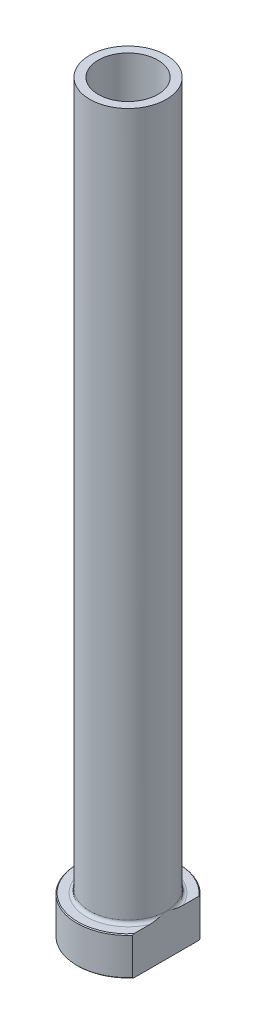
ISO-10303-21;
HEADER;
FILE_DESCRIPTION(('STEP AP214'),'2;1');
FILE_NAME('part.step','',(''),(''),'','','');
FILE_SCHEMA(('AUTOMOTIVE_DESIGN { 1 0 10303 214 1 1 1 1 }'));
ENDSEC;
DATA;
#1=APPLICATION_CONTEXT('core data for automotive mechanical design processes');
#2=APPLICATION_PROTOCOL_DEFINITION('international standard','automotive_design',2000,#1);
#3=PRODUCT_CONTEXT('',#1,'mechanical');
#4=PRODUCT('Part','Part','',(#3));
#5=PRODUCT_RELATED_PRODUCT_CATEGORY('part','',(#4));
#6=PRODUCT_DEFINITION_FORMATION('','',#4);
#7=PRODUCT_DEFINITION_CONTEXT('part definition',#1,'design');
#8=PRODUCT_DEFINITION('design','',#6,#7);
#9=PRODUCT_DEFINITION_SHAPE('','',#8);
#10=(LENGTH_UNIT() NAMED_UNIT(*) SI_UNIT(.MILLI.,.METRE.));
#11=(NAMED_UNIT(*) PLANE_ANGLE_UNIT() SI_UNIT($,.RADIAN.));
#12=(NAMED_UNIT(*) SI_UNIT($,.STERADIAN.) SOLID_ANGLE_UNIT());
#13=UNCERTAINTY_MEASURE_WITH_UNIT(LENGTH_MEASURE(1.E-05),#10,'distance_accuracy_value','');
#14=(GEOMETRIC_REPRESENTATION_CONTEXT(3) GLOBAL_UNCERTAINTY_ASSIGNED_CONTEXT((#13)) GLOBAL_UNIT_ASSIGNED_CONTEXT((#10,
#11,#12)) REPRESENTATION_CONTEXT('',''));
#15=CARTESIAN_POINT('',(0.,0.,0.));
#16=DIRECTION('',(0.,0.,1.));
#17=DIRECTION('',(1.,0.,0.));
#18=AXIS2_PLACEMENT_3D('',#15,#16,#17);
#19=CARTESIAN_POINT('',(0.,92.1876809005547,0.));
#20=DIRECTION('',(0.,1.,0.));
#21=DIRECTION('',(0.,0.,1.));
#22=AXIS2_PLACEMENT_3D('',#19,#20,#21);
#23=CYLINDRICAL_SURFACE('',#22,7.);
#24=CARTESIAN_POINT('',(0.,175.,0.));
#25=DIRECTION('',(0.,1.,0.));
#26=DIRECTION('',(0.,0.,1.));
#27=AXIS2_PLACEMENT_3D('',#24,#25,#26);
#28=CIRCLE('',#27,7.);
#29=CARTESIAN_POINT('',(0.,175.,7.));
#30=VERTEX_POINT('',#29);
#31=EDGE_CURVE('E167',#30,#30,#28,.T.);
#32=ORIENTED_EDGE('',*,*,#31,.T.);
#33=EDGE_LOOP('',(#32));
#34=FACE_BOUND('',#33,.T.);
#35=CARTESIAN_POINT('',(0.,120.,0.));
#36=DIRECTION('',(0.,1.,0.));
#37=DIRECTION('',(0.,0.,1.));
#38=AXIS2_PLACEMENT_3D('',#35,#36,#37);
#39=CIRCLE('',#38,7.);
#40=CARTESIAN_POINT('',(0.,120.,7.));
#41=VERTEX_POINT('',#40);
#42=EDGE_CURVE('E170',#41,#41,#39,.T.);
#43=ORIENTED_EDGE('',*,*,#42,.F.);
#44=EDGE_LOOP('',(#43));
#45=FACE_BOUND('',#44,.T.);
#46=ADVANCED_FACE('F32',(#34,#45),#23,.F.);
#47=CARTESIAN_POINT('',(-7.,175.,0.));
#48=DIRECTION('',(0.,1.,0.));
#49=DIRECTION('',(0.,0.,1.));
#50=AXIS2_PLACEMENT_3D('',#47,#48,#49);
#51=PLANE('',#50);
#52=CARTESIAN_POINT('',(0.,175.,0.));
#53=DIRECTION('',(0.,1.,0.));
#54=DIRECTION('',(0.,0.,1.));
#55=AXIS2_PLACEMENT_3D('',#52,#53,#54);
#56=CIRCLE('',#55,9.00000000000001);
#57=CARTESIAN_POINT('',(0.,175.,9.00000000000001));
#58=VERTEX_POINT('',#57);
#59=EDGE_CURVE('E174',#58,#58,#56,.T.);
#60=ORIENTED_EDGE('',*,*,#59,.T.);
#61=EDGE_LOOP('',(#60));
#62=FACE_BOUND('',#61,.T.);
#63=ORIENTED_EDGE('',*,*,#31,.F.);
#64=EDGE_LOOP('',(#63));
#65=FACE_BOUND('',#64,.T.);
#66=ADVANCED_FACE('F157',(#62,#65),#51,.T.);
#67=CARTESIAN_POINT('',(0.,92.1876809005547,0.));
#68=DIRECTION('',(0.,1.,0.));
#69=DIRECTION('',(0.,0.,1.));
#70=AXIS2_PLACEMENT_3D('',#67,#68,#69);
#71=CYLINDRICAL_SURFACE('',#70,9.);
#72=CARTESIAN_POINT('',(0.,9.8,0.));
#73=DIRECTION('',(0.,1.,0.));
#74=DIRECTION('',(0.,0.,1.));
#75=AXIS2_PLACEMENT_3D('',#72,#73,#74);
#76=CIRCLE('',#75,9.);
#77=CARTESIAN_POINT('',(9.,9.8,0.));
#78=VERTEX_POINT('',#77);
#79=EDGE_CURVE('E180',#78,#78,#76,.T.);
#80=ORIENTED_EDGE('',*,*,#79,.T.);
#81=EDGE_LOOP('',(#80));
#82=FACE_BOUND('',#81,.T.);
#83=ORIENTED_EDGE('',*,*,#59,.F.);
#84=EDGE_LOOP('',(#83));
#85=FACE_BOUND('',#84,.T.);
#86=ADVANCED_FACE('F162',(#82,#85),#71,.T.);
#87=CARTESIAN_POINT('',(-8.99999999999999,9.,0.));
#88=DIRECTION('',(0.,1.,0.));
#89=DIRECTION('',(0.,0.,1.));
#90=AXIS2_PLACEMENT_3D('',#87,#88,#89);
#91=PLANE('',#90);
#92=DIRECTION('',(0.,0.,1.));
#93=VECTOR('',#92,1.);
#94=CARTESIAN_POINT('',(9.,9.,0.));
#95=LINE('',#94,#93);
#96=CARTESIAN_POINT('',(9.,9.,-7.63151361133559));
#97=VERTEX_POINT('',#96);
#98=CARTESIAN_POINT('',(9.,9.,-3.87814388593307));
#99=VERTEX_POINT('',#98);
#100=EDGE_CURVE('E54',#97,#99,#95,.T.);
#101=ORIENTED_EDGE('',*,*,#100,.F.);
#102=CARTESIAN_POINT('',(0.,9.,0.));
#103=DIRECTION('',(0.,1.,0.));
#104=DIRECTION('',(0.,0.,1.));
#105=AXIS2_PLACEMENT_3D('',#102,#103,#104);
#106=CIRCLE('',#105,11.8);
#107=CARTESIAN_POINT('',(8.99999999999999,9.,7.63151361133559));
#108=VERTEX_POINT('',#107);
#109=EDGE_CURVE('E186',#97,#108,#106,.T.);
#110=ORIENTED_EDGE('',*,*,#109,.T.);
#111=CARTESIAN_POINT('',(9.,9.,3.87814388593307));
#112=VERTEX_POINT('',#111);
#113=EDGE_CURVE('E134',#112,#108,#95,.T.);
#114=ORIENTED_EDGE('',*,*,#113,.F.);
#115=CARTESIAN_POINT('',(0.,9.,0.));
#116=DIRECTION('',(0.,1.,0.));
#117=DIRECTION('',(0.,0.,1.));
#118=AXIS2_PLACEMENT_3D('',#115,#116,#117);
#119=CIRCLE('',#118,9.8);
#120=EDGE_CURVE('E183',#112,#99,#119,.F.);
#121=ORIENTED_EDGE('',*,*,#120,.T.);
#122=EDGE_LOOP('',(#101,#110,#114,#121));
#123=FACE_BOUND('',#122,.T.);
#124=ADVANCED_FACE('F197',(#123),#91,.T.);
#125=CARTESIAN_POINT('',(0.,92.1876809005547,0.));
#126=DIRECTION('',(0.,1.,0.));
#127=DIRECTION('',(0.,0.,1.));
#128=AXIS2_PLACEMENT_3D('',#125,#126,#127);
#129=CYLINDRICAL_SURFACE('',#128,12.);
#130=DIRECTION('',(0.,-1.,0.));
#131=VECTOR('',#130,1.);
#132=CARTESIAN_POINT('',(8.99999999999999,175.,7.93725393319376));
#133=LINE('',#132,#131);
#134=CARTESIAN_POINT('',(8.99999999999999,8.8,7.93725393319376));
#135=VERTEX_POINT('',#134);
#136=CARTESIAN_POINT('',(8.99999999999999,0.200000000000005,7.93725393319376));
#137=VERTEX_POINT('',#136);
#138=EDGE_CURVE('E82',#135,#137,#133,.T.);
#139=ORIENTED_EDGE('',*,*,#138,.F.);
#140=CARTESIAN_POINT('',(0.,8.8,0.));
#141=DIRECTION('',(0.,1.,0.));
#142=DIRECTION('',(0.,0.,1.));
#143=AXIS2_PLACEMENT_3D('',#140,#141,#142);
#144=CIRCLE('',#143,12.);
#145=CARTESIAN_POINT('',(9.,8.8,-7.93725393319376));
#146=VERTEX_POINT('',#145);
#147=EDGE_CURVE('E95',#135,#146,#144,.F.);
#148=ORIENTED_EDGE('',*,*,#147,.T.);
#149=DIRECTION('',(0.,-1.,0.));
#150=VECTOR('',#149,1.);
#151=CARTESIAN_POINT('',(9.,175.,-7.93725393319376));
#152=LINE('',#151,#150);
#153=CARTESIAN_POINT('',(9.,0.200000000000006,-7.93725393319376));
#154=VERTEX_POINT('',#153);
#155=EDGE_CURVE('E192',#146,#154,#152,.T.);
#156=ORIENTED_EDGE('',*,*,#155,.T.);
#157=CARTESIAN_POINT('',(0.,0.200000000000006,0.));
#158=DIRECTION('',(0.,-1.,0.));
#159=DIRECTION('',(0.,0.,-1.));
#160=AXIS2_PLACEMENT_3D('',#157,#158,#159);
#161=CIRCLE('',#160,12.);
#162=EDGE_CURVE('E98',#154,#137,#161,.F.);
#163=ORIENTED_EDGE('',*,*,#162,.T.);
#164=EDGE_LOOP('',(#139,#148,#156,#163));
#165=FACE_BOUND('',#164,.T.);
#166=ADVANCED_FACE('F190',(#165),#129,.T.);
#167=CARTESIAN_POINT('',(-12.,0.,0.));
#168=DIRECTION('',(0.,-1.,0.));
#169=DIRECTION('',(0.,0.,-1.));
#170=AXIS2_PLACEMENT_3D('',#167,#168,#169);
#171=PLANE('',#170);
#172=CARTESIAN_POINT('',(0.,0.,0.));
#173=DIRECTION('',(0.,-1.,0.));
#174=DIRECTION('',(0.,0.,-1.));
#175=AXIS2_PLACEMENT_3D('',#172,#173,#174);
#176=CIRCLE('',#175,7.75000000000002);
#177=CARTESIAN_POINT('',(0.,0.,-7.75000000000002));
#178=VERTEX_POINT('',#177);
#179=EDGE_CURVE('E40',#178,#178,#176,.F.);
#180=ORIENTED_EDGE('',*,*,#179,.T.);
#181=EDGE_LOOP('',(#180));
#182=FACE_BOUND('',#181,.T.);
#183=DIRECTION('',(0.,0.,-1.));
#184=VECTOR('',#183,1.);
#185=CARTESIAN_POINT('',(8.99999999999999,0.,7.93725393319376));
#186=LINE('',#185,#184);
#187=CARTESIAN_POINT('',(8.99999999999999,0.,7.63151361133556));
#188=VERTEX_POINT('',#187);
#189=CARTESIAN_POINT('',(9.,0.,-7.63151361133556));
#190=VERTEX_POINT('',#189);
#191=EDGE_CURVE('E47',#188,#190,#186,.T.);
#192=ORIENTED_EDGE('',*,*,#191,.F.);
#193=CARTESIAN_POINT('',(0.,0.,0.));
#194=DIRECTION('',(0.,-1.,0.));
#195=DIRECTION('',(0.,0.,-1.));
#196=AXIS2_PLACEMENT_3D('',#193,#194,#195);
#197=CIRCLE('',#196,11.8);
#198=EDGE_CURVE('E92',#188,#190,#197,.T.);
#199=ORIENTED_EDGE('',*,*,#198,.T.);
#200=EDGE_LOOP('',(#192,#199));
#201=FACE_BOUND('',#200,.T.);
#202=ADVANCED_FACE('F91',(#182,#201),#171,.T.);
#203=CARTESIAN_POINT('',(0.,92.1876809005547,0.));
#204=DIRECTION('',(0.,1.,0.));
#205=DIRECTION('',(0.,0.,1.));
#206=AXIS2_PLACEMENT_3D('',#203,#204,#205);
#207=CYLINDRICAL_SURFACE('',#206,7.25);
#208=CARTESIAN_POINT('',(0.,0.500000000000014,0.));
#209=DIRECTION('',(0.,-1.,0.));
#210=DIRECTION('',(0.,0.,-1.));
#211=AXIS2_PLACEMENT_3D('',#208,#209,#210);
#212=CIRCLE('',#211,7.25);
#213=CARTESIAN_POINT('',(0.,0.500000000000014,-7.25));
#214=VERTEX_POINT('',#213);
#215=EDGE_CURVE('E11',#214,#214,#212,.T.);
#216=ORIENTED_EDGE('',*,*,#215,.T.);
#217=EDGE_LOOP('',(#216));
#218=FACE_BOUND('',#217,.T.);
#219=CARTESIAN_POINT('',(0.,108.,0.));
#220=DIRECTION('',(0.,1.,0.));
#221=DIRECTION('',(0.,0.,1.));
#222=AXIS2_PLACEMENT_3D('',#219,#220,#221);
#223=CIRCLE('',#222,7.25);
#224=CARTESIAN_POINT('',(0.,108.,7.25));
#225=VERTEX_POINT('',#224);
#226=EDGE_CURVE('E172',#225,#225,#223,.T.);
#227=ORIENTED_EDGE('',*,*,#226,.T.);
#228=EDGE_LOOP('',(#227));
#229=FACE_BOUND('',#228,.T.);
#230=ADVANCED_FACE('F215',(#218,#229),#207,.F.);
#231=CARTESIAN_POINT('',(0.,108.,0.));
#232=DIRECTION('',(0.,-1.,0.));
#233=DIRECTION('',(0.,0.,-1.));
#234=AXIS2_PLACEMENT_3D('',#231,#232,#233);
#235=CONICAL_SURFACE('',#234,7.25,0.0208303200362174);
#236=ORIENTED_EDGE('',*,*,#42,.T.);
#237=EDGE_LOOP('',(#236));
#238=FACE_BOUND('',#237,.T.);
#239=ORIENTED_EDGE('',*,*,#226,.F.);
#240=EDGE_LOOP('',(#239));
#241=FACE_BOUND('',#240,.T.);
#242=ADVANCED_FACE('F111',(#238,#241),#235,.F.);
#243=CARTESIAN_POINT('',(0.,9.8,0.));
#244=DIRECTION('',(0.,1.,0.));
#245=DIRECTION('',(0.,0.,1.));
#246=AXIS2_PLACEMENT_3D('',#243,#244,#245);
#247=TOROIDAL_SURFACE('',#246,9.8,0.8);
#248=ORIENTED_EDGE('',*,*,#120,.F.);
#249=CARTESIAN_POINT('',(9.,9.8,0.));
#250=CARTESIAN_POINT('',(9.,9.80000101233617,-6.46837226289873E-11));
#251=CARTESIAN_POINT('',(9.,9.80000202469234,3.1733241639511E-07));
#252=CARTESIAN_POINT('',(9.,9.80000393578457,1.24154711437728E-06));
#253=CARTESIAN_POINT('',(9.,9.80000482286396,1.86583013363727E-06));
#254=CARTESIAN_POINT('',(9.,9.80000663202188,3.35641272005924E-06));
#255=CARTESIAN_POINT('',(9.,9.80000753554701,4.245673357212E-06));
#256=CARTESIAN_POINT('',(9.,9.80000918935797,6.11612133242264E-06));
#257=CARTESIAN_POINT('',(9.,9.80000994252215,7.09491962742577E-06));
#258=CARTESIAN_POINT('',(9.,9.80001263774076,1.07802695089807E-05));
#259=CARTESIAN_POINT('',(9.,9.80001442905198,1.36008580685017E-05));
#260=CARTESIAN_POINT('',(9.,9.80001746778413,1.9272252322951E-05));
#261=CARTESIAN_POINT('',(9.,9.80001874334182,2.2108720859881E-05));
#262=CARTESIAN_POINT('',(9.,9.80002390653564,3.37975021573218E-05));
#263=CARTESIAN_POINT('',(9.,9.80002763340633,4.27293144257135E-05));
#264=CARTESIAN_POINT('',(9.,9.80003330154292,5.98324777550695E-05));
#265=CARTESIAN_POINT('',(9.,9.80003541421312,6.79472930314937E-05));
#266=CARTESIAN_POINT('',(9.,9.80005049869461,0.000127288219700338));
#267=CARTESIAN_POINT('',(9.,9.80006163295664,0.000178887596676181));
#268=CARTESIAN_POINT('',(8.99999999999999,9.80011034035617,0.000381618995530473));
#269=CARTESIAN_POINT('',(9.,9.80015710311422,0.000530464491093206));
#270=CARTESIAN_POINT('',(9.,9.80033804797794,0.0011172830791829));
#271=CARTESIAN_POINT('',(9.,9.80046603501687,0.00155660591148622));
#272=CARTESIAN_POINT('',(8.99999999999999,9.80097635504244,0.003294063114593));
#273=CARTESIAN_POINT('',(8.99999999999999,9.80136631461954,0.00459050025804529));
#274=CARTESIAN_POINT('',(9.,9.80298403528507,0.00998416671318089));
#275=CARTESIAN_POINT('',(9.,9.80420236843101,0.0140834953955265));
#276=CARTESIAN_POINT('',(8.99999999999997,9.82648661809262,0.089042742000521));
#277=CARTESIAN_POINT('',(8.99999999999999,9.84764626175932,0.159882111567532));
#278=CARTESIAN_POINT('',(9.,9.8889590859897,0.298764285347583));
#279=CARTESIAN_POINT('',(9.,9.90911860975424,0.366805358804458));
#280=CARTESIAN_POINT('',(8.99999999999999,9.95179311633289,0.511524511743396));
#281=CARTESIAN_POINT('',(9.,9.97428452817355,0.588209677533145));
#282=CARTESIAN_POINT('',(9.,10.0191408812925,0.742532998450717));
#283=CARTESIAN_POINT('',(9.,10.0415017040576,0.820172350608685));
#284=CARTESIAN_POINT('',(9.,10.079411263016,0.953448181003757));
#285=CARTESIAN_POINT('',(9.,10.0950851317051,1.00904901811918));
#286=CARTESIAN_POINT('',(9.,10.1260784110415,1.12019530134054));
#287=CARTESIAN_POINT('',(9.,10.1413986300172,1.17574052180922));
#288=CARTESIAN_POINT('',(9.,10.1860703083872,1.33980716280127));
#289=CARTESIAN_POINT('',(9.,10.2149083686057,1.44846861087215));
#290=CARTESIAN_POINT('',(9.,10.2856369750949,1.72417832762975));
#291=CARTESIAN_POINT('',(9.,10.3263124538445,1.89154391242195));
#292=CARTESIAN_POINT('',(9.,10.4020454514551,2.22904779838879));
#293=CARTESIAN_POINT('',(9.,10.4370523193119,2.39919757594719));
#294=CARTESIAN_POINT('',(9.,10.5014391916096,2.75494052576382));
#295=CARTESIAN_POINT('',(9.,10.5301301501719,2.94066439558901));
#296=CARTESIAN_POINT('',(9.,10.5633122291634,3.22016202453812));
#297=CARTESIAN_POINT('',(9.,10.5727244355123,3.31335338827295));
#298=CARTESIAN_POINT('',(9.,10.5877042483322,3.50003892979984));
#299=CARTESIAN_POINT('',(9.,10.5932725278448,3.59353305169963));
#300=CARTESIAN_POINT('',(9.,10.5997812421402,3.77831079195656));
#301=CARTESIAN_POINT('',(9.,10.6008358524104,3.8695901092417));
#302=CARTESIAN_POINT('',(9.,10.5977997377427,4.05215299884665));
#303=CARTESIAN_POINT('',(8.99999999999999,10.5937049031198,4.14343651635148));
#304=CARTESIAN_POINT('',(8.99999999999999,10.5793848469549,4.32415905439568));
#305=CARTESIAN_POINT('',(8.99999999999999,10.5692536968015,4.41360502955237));
#306=CARTESIAN_POINT('',(8.99999999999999,10.5415393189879,4.59125765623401));
#307=CARTESIAN_POINT('',(8.99999999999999,10.5239649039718,4.67946564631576));
#308=CARTESIAN_POINT('',(8.99999999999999,10.4790565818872,4.85471882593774));
#309=CARTESIAN_POINT('',(8.99999999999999,10.4516029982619,4.94173554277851));
#310=CARTESIAN_POINT('',(8.99999999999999,10.4007972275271,5.06830195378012));
#311=CARTESIAN_POINT('',(8.99999999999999,10.3822808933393,5.1097917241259));
#312=CARTESIAN_POINT('',(8.99999999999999,10.3414775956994,5.19085457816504));
#313=CARTESIAN_POINT('',(8.99999999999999,10.3191952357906,5.23042992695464));
#314=CARTESIAN_POINT('',(8.99999999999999,10.2750362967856,5.29920261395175));
#315=CARTESIAN_POINT('',(8.99999999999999,10.2539514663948,5.32890420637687));
#316=CARTESIAN_POINT('',(8.99999999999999,10.2085010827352,5.38577147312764));
#317=CARTESIAN_POINT('',(8.99999999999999,10.1841327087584,5.41293493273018));
#318=CARTESIAN_POINT('',(8.99999999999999,10.1314615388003,5.46389233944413));
#319=CARTESIAN_POINT('',(8.99999999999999,10.1031152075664,5.48764214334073));
#320=CARTESIAN_POINT('',(8.99999999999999,10.04261248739,5.52966859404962));
#321=CARTESIAN_POINT('',(8.99999999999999,10.0104678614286,5.54796155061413));
#322=CARTESIAN_POINT('',(8.99999999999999,9.95377518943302,5.57238639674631));
#323=CARTESIAN_POINT('',(8.99999999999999,9.93009823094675,5.58053697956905));
#324=CARTESIAN_POINT('',(8.99999999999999,9.88171464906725,5.59278453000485));
#325=CARTESIAN_POINT('',(8.99999999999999,9.85700894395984,5.59688503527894));
#326=CARTESIAN_POINT('',(8.99999999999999,9.80717489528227,5.60067699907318));
#327=CARTESIAN_POINT('',(8.99999999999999,9.78204544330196,5.60035415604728));
#328=CARTESIAN_POINT('',(8.99999999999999,9.73223420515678,5.59529565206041));
#329=CARTESIAN_POINT('',(8.99999999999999,9.7075525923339,5.5905583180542));
#330=CARTESIAN_POINT('',(8.99999999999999,9.66020362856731,5.57733425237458));
#331=CARTESIAN_POINT('',(8.99999999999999,9.63749568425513,5.56898983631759));
#332=CARTESIAN_POINT('',(8.99999999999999,9.5935151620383,5.54915687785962));
#333=CARTESIAN_POINT('',(8.99999999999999,9.57224307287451,5.5376672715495));
#334=CARTESIAN_POINT('',(8.99999999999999,9.51928150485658,5.50462580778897));
#335=CARTESIAN_POINT('',(8.99999999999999,9.48880776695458,5.4811266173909));
#336=CARTESIAN_POINT('',(8.99999999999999,9.43189052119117,5.42965338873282));
#337=CARTESIAN_POINT('',(8.99999999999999,9.40546009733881,5.40166539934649));
#338=CARTESIAN_POINT('',(8.99999999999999,9.34005551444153,5.32319042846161));
#339=CARTESIAN_POINT('',(8.99999999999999,9.3043047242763,5.27003866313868));
#340=CARTESIAN_POINT('',(8.99999999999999,9.24095813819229,5.15926391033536));
#341=CARTESIAN_POINT('',(8.99999999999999,9.21336826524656,5.10163771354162));
#342=CARTESIAN_POINT('',(8.99999999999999,9.16551403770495,4.98579619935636));
#343=CARTESIAN_POINT('',(8.99999999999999,9.14502939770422,4.92767012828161));
#344=CARTESIAN_POINT('',(8.99999999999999,9.10900516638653,4.80987690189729));
#345=CARTESIAN_POINT('',(8.99999999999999,9.09347054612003,4.75020826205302));
#346=CARTESIAN_POINT('',(8.99999999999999,9.06639912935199,4.6292635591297));
#347=CARTESIAN_POINT('',(8.99999999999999,9.05491059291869,4.56797688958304));
#348=CARTESIAN_POINT('',(8.99999999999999,9.0355498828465,4.44488746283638));
#349=CARTESIAN_POINT('',(8.99999999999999,9.02767548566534,4.38308504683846));
#350=CARTESIAN_POINT('',(8.99999999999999,9.01237706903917,4.23320098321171));
#351=CARTESIAN_POINT('',(8.99999999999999,9.00652460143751,4.14495990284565));
#352=CARTESIAN_POINT('',(8.99999999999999,8.99996624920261,3.96827125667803));
#353=CARTESIAN_POINT('',(9.,8.99926276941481,3.87982361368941));
#354=CARTESIAN_POINT('',(9.,9.00218728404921,3.70272096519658));
#355=CARTESIAN_POINT('',(9.,9.00582939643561,3.61406622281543));
#356=CARTESIAN_POINT('',(9.,9.01681466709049,3.43698088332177));
#357=CARTESIAN_POINT('',(9.,9.02415848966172,3.34855032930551));
#358=CARTESIAN_POINT('',(9.,9.04989749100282,3.09391807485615));
#359=CARTESIAN_POINT('',(9.,9.0723219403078,2.92812217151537));
#360=CARTESIAN_POINT('',(9.,9.12539895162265,2.59921508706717));
#361=CARTESIAN_POINT('',(9.,9.15598725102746,2.43609307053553));
#362=CARTESIAN_POINT('',(9.,9.22330285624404,2.11182788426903));
#363=CARTESIAN_POINT('',(9.,9.26000471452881,1.95067936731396));
#364=CARTESIAN_POINT('',(9.,9.31897632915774,1.70786584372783));
#365=CARTESIAN_POINT('',(9.,9.33955107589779,1.62578051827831));
#366=CARTESIAN_POINT('',(9.,9.38177259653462,1.46165638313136));
#367=CARTESIAN_POINT('',(9.,9.4034220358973,1.37961825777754));
#368=CARTESIAN_POINT('',(9.,9.45602430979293,1.18435079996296));
#369=CARTESIAN_POINT('',(9.,9.48736095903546,1.07122519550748));
#370=CARTESIAN_POINT('',(9.,9.55083956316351,0.846545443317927));
#371=CARTESIAN_POINT('',(9.,9.58296886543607,0.734987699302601));
#372=CARTESIAN_POINT('',(8.99999999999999,9.64431039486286,0.524609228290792));
#373=CARTESIAN_POINT('',(8.99999999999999,9.67344475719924,0.425765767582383));
#374=CARTESIAN_POINT('',(9.,9.71808680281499,0.275077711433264));
#375=CARTESIAN_POINT('',(9.,9.73349584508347,0.223203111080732));
#376=CARTESIAN_POINT('',(8.99999999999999,9.76415269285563,0.120285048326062));
#377=CARTESIAN_POINT('',(8.99999999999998,9.7793992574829,0.0692412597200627));
#378=CARTESIAN_POINT('',(9.,9.79579831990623,0.0140813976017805));
#379=CARTESIAN_POINT('',(9.,9.7970172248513,0.00997994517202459));
#380=CARTESIAN_POINT('',(8.99999999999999,9.79863508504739,0.00458578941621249));
#381=CARTESIAN_POINT('',(8.99999999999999,9.79902455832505,0.00329097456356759));
#382=CARTESIAN_POINT('',(9.,9.79953428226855,0.00155554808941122));
#383=CARTESIAN_POINT('',(9.,9.79966215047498,0.00111663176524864));
#384=CARTESIAN_POINT('',(9.,9.79984295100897,0.000530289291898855));
#385=CARTESIAN_POINT('',(8.99999999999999,9.79988969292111,0.000381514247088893));
#386=CARTESIAN_POINT('',(9.,9.79993838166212,0.000178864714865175));
#387=CARTESIAN_POINT('',(9.,9.79994951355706,0.000127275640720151));
#388=CARTESIAN_POINT('',(9.,9.79996459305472,6.79451326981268E-05));
#389=CARTESIAN_POINT('',(9.,9.79996670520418,5.98309285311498E-05));
#390=CARTESIAN_POINT('',(9.,9.79997237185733,4.27289821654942E-05));
#391=CARTESIAN_POINT('',(9.,9.79997609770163,3.37977439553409E-05));
#392=CARTESIAN_POINT('',(9.,9.79998125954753,2.21095447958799E-05));
#393=CARTESIAN_POINT('',(9.,9.79998253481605,1.92731218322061E-05));
#394=CARTESIAN_POINT('',(9.,9.79998557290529,1.36017677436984E-05));
#395=CARTESIAN_POINT('',(9.,9.79998736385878,1.07811687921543E-05));
#396=CARTESIAN_POINT('',(9.,9.79999005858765,7.09574455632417E-06));
#397=CARTESIAN_POINT('',(9.,9.79999081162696,6.11691132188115E-06));
#398=CARTESIAN_POINT('',(9.,9.79999246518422,4.24637095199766E-06));
#399=CARTESIAN_POINT('',(9.,9.79999336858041,3.35705227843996E-06));
#400=CARTESIAN_POINT('',(9.,9.79999517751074,1.86633170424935E-06));
#401=CARTESIAN_POINT('',(9.,9.79999606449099,1.24197318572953E-06));
#402=CARTESIAN_POINT('',(9.,9.79999797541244,3.1757083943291E-07));
#403=CARTESIAN_POINT('',(9.,9.79999898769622,6.46855868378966E-11));
#404=CARTESIAN_POINT('',(9.,9.8,0.));
#405=B_SPLINE_CURVE_WITH_KNOTS('',3,(#249,#250,#251,#252,#253,#254,#255,#256,#257,#258,#259,
#260,#261,#262,#263,#264,#265,#266,#267,#268,#269,#270,#271,#272,#273,#274,#275,#276,#277,#278,
#279,#280,#281,#282,#283,#284,#285,#286,#287,#288,#289,#290,#291,#292,#293,#294,#295,#296,#297,
#298,#299,#300,#301,#302,#303,#304,#305,#306,#307,#308,#309,#310,#311,#312,#313,#314,#315,#316,
#317,#318,#319,#320,#321,#322,#323,#324,#325,#326,#327,#328,#329,#330,#331,#332,#333,#334,#335,
#336,#337,#338,#339,#340,#341,#342,#343,#344,#345,#346,#347,#348,#349,#350,#351,#352,#353,#354,
#355,#356,#357,#358,#359,#360,#361,#362,#363,#364,#365,#366,#367,#368,#369,#370,#371,#372,#373,
#374,#375,#376,#377,#378,#379,#380,#381,#382,#383,#384,#385,#386,#387,#388,#389,#390,#391,#392,
#393,#394,#395,#396,#397,#398,#399,#400,#401,#402,#403,#404),.UNSPECIFIED.,.T.,.F.,(4,2,2,2,2,2,
2,2,2,2,2,2,2,2,2,2,2,2,2,2,2,2,2,2,2,2,2,2,2,2,2,2,2,2,2,2,2,2,2,2,2,2,2,2,2,2,2,2,2,2,2,2,2,2,
2,2,2,2,2,2,2,2,2,2,2,2,2,2,2,2,2,2,2,2,2,2,2,4),(0.,3.0477175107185E-06,6.29346410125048E-06,
1.0076989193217E-05,1.377912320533E-05,2.37619394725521E-05,3.30844939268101E-05,
6.20552070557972E-05,8.71785192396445E-05,0.000245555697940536,0.000713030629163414,
0.00208637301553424,0.00614710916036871,0.0189775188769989,0.240764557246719,0.453660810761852,
0.693405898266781,0.935790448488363,1.10909318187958,1.28194996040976,1.619210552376,
2.13583880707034,2.65685508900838,3.22023907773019,3.5011731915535,3.78205810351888,
4.05579427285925,4.32974904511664,4.5995421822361,4.8690167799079,5.14187221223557,
5.27802968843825,5.41402191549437,5.52311134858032,5.63229509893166,5.74278355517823,
5.85293838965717,5.92775570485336,6.00250761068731,6.07750126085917,6.15252334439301,
6.2248226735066,6.29714648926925,6.4119295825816,6.52707659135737,6.7181646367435,
6.90939103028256,7.09400621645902,7.27880622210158,7.46574121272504,7.65256103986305,
7.91766914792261,8.18290106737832,8.4489970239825,8.71514075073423,9.21672782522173,
9.71447745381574,10.2102047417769,10.4640739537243,10.7186077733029,11.0707555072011,
11.4190290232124,11.7281703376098,11.8905163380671,12.0503265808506,12.0631635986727,
12.0672192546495,12.068591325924,12.0690585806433,12.0692169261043,12.0692420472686,
12.0692710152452,12.0692803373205,12.0692903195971,12.0692940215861,12.0692978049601,
12.0693010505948,12.0693040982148),.UNSPECIFIED.);
#406=EDGE_CURVE('E126',#112,#78,#405,.T.);
#407=ORIENTED_EDGE('',*,*,#406,.T.);
#408=ORIENTED_EDGE('',*,*,#79,.F.);
#409=CARTESIAN_POINT('',(9.,9.8,0.));
#410=CARTESIAN_POINT('',(9.,9.79999898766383,6.46880328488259E-11));
#411=CARTESIAN_POINT('',(9.,9.79999797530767,-3.17332412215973E-07));
#412=CARTESIAN_POINT('',(9.,9.79999606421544,-1.24154711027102E-06));
#413=CARTESIAN_POINT('',(9.,9.79999517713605,-1.86583012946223E-06));
#414=CARTESIAN_POINT('',(9.,9.79999336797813,-3.35641271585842E-06));
#415=CARTESIAN_POINT('',(9.,9.799992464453,-4.24567335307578E-06));
#416=CARTESIAN_POINT('',(9.,9.79999081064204,-6.11612132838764E-06));
#417=CARTESIAN_POINT('',(9.,9.79999005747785,-7.09491962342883E-06));
#418=CARTESIAN_POINT('',(9.,9.79998736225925,-1.07802695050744E-05));
#419=CARTESIAN_POINT('',(9.,9.79998557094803,-1.36008580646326E-05));
#420=CARTESIAN_POINT('',(9.,9.79998253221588,-1.92722523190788E-05));
#421=CARTESIAN_POINT('',(9.,9.79998125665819,-2.21087208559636E-05));
#422=CARTESIAN_POINT('',(9.,9.79997609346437,-3.37975021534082E-05));
#423=CARTESIAN_POINT('',(9.,9.79997236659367,-4.27293144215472E-05));
#424=CARTESIAN_POINT('',(9.,9.79996669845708,-5.98324777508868E-05));
#425=CARTESIAN_POINT('',(9.,9.79996458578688,-6.79472930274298E-05));
#426=CARTESIAN_POINT('',(9.,9.7999495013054,-0.000127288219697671));
#427=CARTESIAN_POINT('',(9.,9.79993836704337,-0.000178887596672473));
#428=CARTESIAN_POINT('',(8.99999999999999,9.79988965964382,-0.00038161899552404));
#429=CARTESIAN_POINT('',(9.,9.79984289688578,-0.000530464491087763));
#430=CARTESIAN_POINT('',(9.,9.79966195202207,-0.00111728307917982));
#431=CARTESIAN_POINT('',(9.,9.79953396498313,-0.00155660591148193));
#432=CARTESIAN_POINT('',(8.99999999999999,9.79902364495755,-0.00329406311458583));
#433=CARTESIAN_POINT('',(8.99999999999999,9.79863368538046,-0.00459050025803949));
#434=CARTESIAN_POINT('',(9.,9.79701596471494,-0.00998416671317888));
#435=CARTESIAN_POINT('',(9.,9.79579763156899,-0.0140834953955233));
#436=CARTESIAN_POINT('',(8.99999999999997,9.77351338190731,-0.0890427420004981));
#437=CARTESIAN_POINT('',(8.99999999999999,9.75235373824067,-0.159882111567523));
#438=CARTESIAN_POINT('',(9.,9.71104091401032,-0.298764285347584));
#439=CARTESIAN_POINT('',(9.,9.69088139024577,-0.366805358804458));
#440=CARTESIAN_POINT('',(8.99999999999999,9.64820688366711,-0.511524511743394));
#441=CARTESIAN_POINT('',(9.,9.62571547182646,-0.588209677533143));
#442=CARTESIAN_POINT('',(9.,9.5808591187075,-0.742532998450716));
#443=CARTESIAN_POINT('',(9.,9.55849829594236,-0.820172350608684));
#444=CARTESIAN_POINT('',(9.,9.52058873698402,-0.953448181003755));
#445=CARTESIAN_POINT('',(9.,9.50491486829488,-1.00904901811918));
#446=CARTESIAN_POINT('',(9.,9.47392158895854,-1.12019530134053));
#447=CARTESIAN_POINT('',(9.,9.45860136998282,-1.17574052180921));
#448=CARTESIAN_POINT('',(9.,9.41392969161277,-1.33980716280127));
#449=CARTESIAN_POINT('',(9.,9.38509163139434,-1.44846861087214));
#450=CARTESIAN_POINT('',(9.,9.31436302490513,-1.72417832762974));
#451=CARTESIAN_POINT('',(9.,9.27368754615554,-1.89154391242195));
#452=CARTESIAN_POINT('',(9.,9.19795454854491,-2.22904779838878));
#453=CARTESIAN_POINT('',(9.,9.16294768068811,-2.39919757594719));
#454=CARTESIAN_POINT('',(9.,9.09856080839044,-2.75494052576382));
#455=CARTESIAN_POINT('',(9.,9.06986984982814,-2.940664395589));
#456=CARTESIAN_POINT('',(9.,9.03668777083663,-3.22016202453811));
#457=CARTESIAN_POINT('',(9.,9.0272755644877,-3.31335338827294));
#458=CARTESIAN_POINT('',(9.,9.01229575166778,-3.50003892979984));
#459=CARTESIAN_POINT('',(9.,9.00672747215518,-3.59353305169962));
#460=CARTESIAN_POINT('',(9.,9.00021875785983,-3.77831079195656));
#461=CARTESIAN_POINT('',(9.,8.99916414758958,-3.8695901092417));
#462=CARTESIAN_POINT('',(9.,9.00220026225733,-4.05215299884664));
#463=CARTESIAN_POINT('',(9.,9.00629509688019,-4.14343651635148));
#464=CARTESIAN_POINT('',(9.,9.02061515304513,-4.32415905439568));
#465=CARTESIAN_POINT('',(9.,9.03074630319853,-4.41360502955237));
#466=CARTESIAN_POINT('',(9.,9.05846068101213,-4.59125765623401));
#467=CARTESIAN_POINT('',(9.,9.0760350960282,-4.67946564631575));
#468=CARTESIAN_POINT('',(9.,9.12094341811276,-4.85471882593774));
#469=CARTESIAN_POINT('',(9.,9.14839700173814,-4.9417355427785));
#470=CARTESIAN_POINT('',(9.,9.19920277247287,-5.06830195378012));
#471=CARTESIAN_POINT('',(9.,9.2177191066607,-5.1097917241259));
#472=CARTESIAN_POINT('',(9.,9.25852240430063,-5.19085457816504));
#473=CARTESIAN_POINT('',(9.,9.28080476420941,-5.23042992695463));
#474=CARTESIAN_POINT('',(9.,9.32496370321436,-5.29920261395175));
#475=CARTESIAN_POINT('',(9.,9.34604853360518,-5.32890420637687));
#476=CARTESIAN_POINT('',(9.,9.39149891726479,-5.38577147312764));
#477=CARTESIAN_POINT('',(9.,9.41586729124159,-5.41293493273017));
#478=CARTESIAN_POINT('',(9.,9.46853846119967,-5.46389233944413));
#479=CARTESIAN_POINT('',(9.,9.49688479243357,-5.48764214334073));
#480=CARTESIAN_POINT('',(9.,9.55738751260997,-5.52966859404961));
#481=CARTESIAN_POINT('',(9.,9.58953213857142,-5.54796155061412));
#482=CARTESIAN_POINT('',(9.,9.64622481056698,-5.5723863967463));
#483=CARTESIAN_POINT('',(9.,9.66990176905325,-5.58053697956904));
#484=CARTESIAN_POINT('',(9.,9.71828535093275,-5.59278453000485));
#485=CARTESIAN_POINT('',(9.,9.74299105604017,-5.59688503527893));
#486=CARTESIAN_POINT('',(9.,9.79282510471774,-5.60067699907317));
#487=CARTESIAN_POINT('',(9.,9.81795455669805,-5.60035415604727));
#488=CARTESIAN_POINT('',(9.,9.86776579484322,-5.59529565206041));
#489=CARTESIAN_POINT('',(9.,9.89244740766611,-5.5905583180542));
#490=CARTESIAN_POINT('',(9.,9.93979637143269,-5.57733425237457));
#491=CARTESIAN_POINT('',(9.,9.96250431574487,-5.56898983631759));
#492=CARTESIAN_POINT('',(9.,10.0064848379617,-5.54915687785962));
#493=CARTESIAN_POINT('',(9.,10.0277569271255,-5.5376672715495));
#494=CARTESIAN_POINT('',(9.,10.0807184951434,-5.50462580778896));
#495=CARTESIAN_POINT('',(9.,10.1111922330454,-5.4811266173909));
#496=CARTESIAN_POINT('',(9.,10.1681094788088,-5.42965338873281));
#497=CARTESIAN_POINT('',(9.,10.1945399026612,-5.40166539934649));
#498=CARTESIAN_POINT('',(9.,10.2599444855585,-5.3231904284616));
#499=CARTESIAN_POINT('',(9.,10.2956952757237,-5.27003866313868));
#500=CARTESIAN_POINT('',(9.,10.3590418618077,-5.15926391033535));
#501=CARTESIAN_POINT('',(9.,10.3866317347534,-5.10163771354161));
#502=CARTESIAN_POINT('',(9.,10.4344859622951,-4.98579619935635));
#503=CARTESIAN_POINT('',(9.,10.4549706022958,-4.9276701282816));
#504=CARTESIAN_POINT('',(9.,10.4909948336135,-4.80987690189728));
#505=CARTESIAN_POINT('',(9.,10.50652945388,-4.75020826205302));
#506=CARTESIAN_POINT('',(9.,10.533600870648,-4.62926355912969));
#507=CARTESIAN_POINT('',(9.,10.5450894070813,-4.56797688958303));
#508=CARTESIAN_POINT('',(9.,10.5644501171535,-4.44488746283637));
#509=CARTESIAN_POINT('',(9.,10.5723245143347,-4.38308504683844));
#510=CARTESIAN_POINT('',(9.,10.5876229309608,-4.2332009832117));
#511=CARTESIAN_POINT('',(9.,10.5934753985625,-4.14495990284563));
#512=CARTESIAN_POINT('',(9.,10.6000337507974,-3.96827125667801));
#513=CARTESIAN_POINT('',(9.,10.6007372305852,-3.8798236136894));
#514=CARTESIAN_POINT('',(9.,10.5978127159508,-3.70272096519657));
#515=CARTESIAN_POINT('',(9.,10.5941706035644,-3.61406622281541));
#516=CARTESIAN_POINT('',(9.,10.5831853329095,-3.43698088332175));
#517=CARTESIAN_POINT('',(9.,10.5758415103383,-3.3485503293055));
#518=CARTESIAN_POINT('',(9.,10.5501025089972,-3.09391807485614));
#519=CARTESIAN_POINT('',(9.,10.5276780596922,-2.92812217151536));
#520=CARTESIAN_POINT('',(9.,10.4746010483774,-2.59921508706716));
#521=CARTESIAN_POINT('',(9.,10.4440127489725,-2.43609307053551));
#522=CARTESIAN_POINT('',(9.,10.376697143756,-2.11182788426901));
#523=CARTESIAN_POINT('',(9.,10.3399952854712,-1.95067936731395));
#524=CARTESIAN_POINT('',(9.,10.2810236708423,-1.70786584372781));
#525=CARTESIAN_POINT('',(9.,10.2604489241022,-1.62578051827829));
#526=CARTESIAN_POINT('',(9.,10.2182274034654,-1.46165638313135));
#527=CARTESIAN_POINT('',(9.,10.1965779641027,-1.37961825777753));
#528=CARTESIAN_POINT('',(9.,10.1439756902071,-1.18435079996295));
#529=CARTESIAN_POINT('',(9.,10.1126390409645,-1.07122519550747));
#530=CARTESIAN_POINT('',(9.,10.0491604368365,-0.846545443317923));
#531=CARTESIAN_POINT('',(9.,10.0170311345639,-0.734987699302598));
#532=CARTESIAN_POINT('',(8.99999999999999,9.95568960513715,-0.524609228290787));
#533=CARTESIAN_POINT('',(8.99999999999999,9.92655524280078,-0.425765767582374));
#534=CARTESIAN_POINT('',(9.,9.88191319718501,-0.275077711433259));
#535=CARTESIAN_POINT('',(9.,9.86650415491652,-0.223203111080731));
#536=CARTESIAN_POINT('',(8.99999999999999,9.83584730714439,-0.120285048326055));
#537=CARTESIAN_POINT('',(8.99999999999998,9.82060074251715,-0.0692412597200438));
#538=CARTESIAN_POINT('',(9.,9.80420168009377,-0.0140813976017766));
#539=CARTESIAN_POINT('',(9.,9.8029827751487,-0.00997994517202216));
#540=CARTESIAN_POINT('',(8.99999999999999,9.80136491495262,-0.00458578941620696));
#541=CARTESIAN_POINT('',(8.99999999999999,9.80097544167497,-0.00329097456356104));
#542=CARTESIAN_POINT('',(9.,9.80046571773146,-0.00155554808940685));
#543=CARTESIAN_POINT('',(9.,9.80033784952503,-0.00111663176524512));
#544=CARTESIAN_POINT('',(9.,9.80015704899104,-0.000530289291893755));
#545=CARTESIAN_POINT('',(8.99999999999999,9.8001103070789,-0.000381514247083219));
#546=CARTESIAN_POINT('',(9.,9.80006161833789,-0.000178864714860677));
#547=CARTESIAN_POINT('',(9.,9.80005048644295,-0.000127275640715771));
#548=CARTESIAN_POINT('',(9.,9.80003540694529,-6.79451326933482E-05));
#549=CARTESIAN_POINT('',(9.,9.80003329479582,-5.98309285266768E-05));
#550=CARTESIAN_POINT('',(9.,9.80002762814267,-4.27289821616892E-05));
#551=CARTESIAN_POINT('',(9.,9.80002390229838,-3.37977439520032E-05));
#552=CARTESIAN_POINT('',(9.,9.80001874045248,-2.2109544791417E-05));
#553=CARTESIAN_POINT('',(9.,9.80001746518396,-1.92731218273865E-05));
#554=CARTESIAN_POINT('',(9.,9.80001442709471,-1.36017677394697E-05));
#555=CARTESIAN_POINT('',(9.,9.80001263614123,-1.078116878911E-05));
#556=CARTESIAN_POINT('',(9.,9.80000994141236,-7.09574455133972E-06));
#557=CARTESIAN_POINT('',(9.,9.80000918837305,-6.11691131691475E-06));
#558=CARTESIAN_POINT('',(9.,9.80000753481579,-4.24637094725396E-06));
#559=CARTESIAN_POINT('',(9.,9.8000066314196,-3.3570522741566E-06));
#560=CARTESIAN_POINT('',(9.,9.80000482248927,-1.86633170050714E-06));
#561=CARTESIAN_POINT('',(9.,9.80000393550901,-1.24197318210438E-06));
#562=CARTESIAN_POINT('',(9.,9.80000202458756,-3.17570836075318E-07));
#563=CARTESIAN_POINT('',(9.,9.80000101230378,-6.46820290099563E-11));
#564=CARTESIAN_POINT('',(9.,9.8,0.));
#565=B_SPLINE_CURVE_WITH_KNOTS('',3,(#409,#410,#411,#412,#413,#414,#415,#416,#417,#418,#419,
#420,#421,#422,#423,#424,#425,#426,#427,#428,#429,#430,#431,#432,#433,#434,#435,#436,#437,#438,
#439,#440,#441,#442,#443,#444,#445,#446,#447,#448,#449,#450,#451,#452,#453,#454,#455,#456,#457,
#458,#459,#460,#461,#462,#463,#464,#465,#466,#467,#468,#469,#470,#471,#472,#473,#474,#475,#476,
#477,#478,#479,#480,#481,#482,#483,#484,#485,#486,#487,#488,#489,#490,#491,#492,#493,#494,#495,
#496,#497,#498,#499,#500,#501,#502,#503,#504,#505,#506,#507,#508,#509,#510,#511,#512,#513,#514,
#515,#516,#517,#518,#519,#520,#521,#522,#523,#524,#525,#526,#527,#528,#529,#530,#531,#532,#533,
#534,#535,#536,#537,#538,#539,#540,#541,#542,#543,#544,#545,#546,#547,#548,#549,#550,#551,#552,
#553,#554,#555,#556,#557,#558,#559,#560,#561,#562,#563,#564),.UNSPECIFIED.,.T.,.F.,(4,2,2,2,2,2,
2,2,2,2,2,2,2,2,2,2,2,2,2,2,2,2,2,2,2,2,2,2,2,2,2,2,2,2,2,2,2,2,2,2,2,2,2,2,2,2,2,2,2,2,2,2,2,2,
2,2,2,2,2,2,2,2,2,2,2,2,2,2,2,2,2,2,2,2,2,2,2,4),(0.,3.04771751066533E-06,6.29346410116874E-06,
1.00769891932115E-05,1.37791232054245E-05,2.37619394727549E-05,3.30844939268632E-05,
6.20552070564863E-05,8.71785192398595E-05,0.000245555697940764,0.000713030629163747,
0.00208637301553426,0.00614710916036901,0.0189775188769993,0.24076455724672,0.453660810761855,
0.693405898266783,0.935790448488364,1.10909318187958,1.28194996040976,1.619210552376,
2.13583880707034,2.65685508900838,3.22023907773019,3.5011731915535,3.78205810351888,
4.05579427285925,4.32974904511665,4.5995421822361,4.86901677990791,5.14187221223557,
5.27802968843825,5.41402191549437,5.52311134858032,5.63229509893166,5.74278355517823,
5.85293838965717,5.92775570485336,6.00250761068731,6.07750126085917,6.15252334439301,
6.2248226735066,6.29714648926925,6.4119295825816,6.52707659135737,6.7181646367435,
6.90939103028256,7.09400621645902,7.27880622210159,7.46574121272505,7.65256103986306,
7.91766914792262,8.18290106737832,8.44899702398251,8.71514075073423,9.21672782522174,
9.71447745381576,10.2102047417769,10.4640739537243,10.718607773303,11.0707555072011,
11.4190290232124,11.7281703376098,11.890516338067,12.0503265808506,12.0631635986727,
12.0672192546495,12.068591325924,12.0690585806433,12.0692169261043,12.0692420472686,
12.0692710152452,12.0692803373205,12.0692903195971,12.0692940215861,12.0692978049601,
12.0693010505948,12.0693040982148),.UNSPECIFIED.);
#566=EDGE_CURVE('E135',#78,#99,#565,.T.);
#567=ORIENTED_EDGE('',*,*,#566,.T.);
#568=EDGE_LOOP('',(#248,#407,#408,#567));
#569=FACE_BOUND('',#568,.T.);
#570=ADVANCED_FACE('F141',(#569),#247,.F.);
#571=CARTESIAN_POINT('',(0.,9.00000000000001,0.));
#572=DIRECTION('',(0.,-1.,0.));
#573=DIRECTION('',(0.,0.,-1.));
#574=AXIS2_PLACEMENT_3D('',#571,#572,#573);
#575=CONICAL_SURFACE('',#574,11.8,0.785398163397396);
#576=CARTESIAN_POINT('',(9.,1.15430366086,-17.4629145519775));
#577=CARTESIAN_POINT('',(9.,1.38083160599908,-17.2080654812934));
#578=CARTESIAN_POINT('',(9.,1.60678492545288,-16.9527052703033));
#579=CARTESIAN_POINT('',(9.,2.0573779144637,-16.4408231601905));
#580=CARTESIAN_POINT('',(9.,2.28201756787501,-16.1843012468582));
#581=CARTESIAN_POINT('',(9.,2.95387487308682,-15.4126051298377));
#582=CARTESIAN_POINT('',(9.,3.398864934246,-14.8954867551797));
#583=CARTESIAN_POINT('',(9.,4.28707339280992,-13.8475750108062));
#584=CARTESIAN_POINT('',(9.,4.73018564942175,-13.3166913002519));
#585=CARTESIAN_POINT('',(9.,5.38667359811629,-12.5137605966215));
#586=CARTESIAN_POINT('',(9.,5.60411991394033,-12.2450411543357));
#587=CARTESIAN_POINT('',(9.,6.03580182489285,-11.705037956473));
#588=CARTESIAN_POINT('',(9.,6.25003746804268,-11.4337542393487));
#589=CARTESIAN_POINT('',(9.,6.66485476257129,-10.9008707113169));
#590=CARTESIAN_POINT('',(9.,6.86560885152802,-10.6394052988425));
#591=CARTESIAN_POINT('',(9.,7.26299613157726,-10.1133666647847));
#592=CARTESIAN_POINT('',(9.,7.45962943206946,-9.84879352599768));
#593=CARTESIAN_POINT('',(9.,7.8480859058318,-9.31586751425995));
#594=CARTESIAN_POINT('',(9.,8.03990586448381,-9.04751229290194));
#595=CARTESIAN_POINT('',(9.,8.41755379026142,-8.5066135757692));
#596=CARTESIAN_POINT('',(9.,8.60338186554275,-8.23407015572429));
#597=CARTESIAN_POINT('',(9.,8.96709703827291,-7.68503423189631));
#598=CARTESIAN_POINT('',(9.,9.14500871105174,-7.40855806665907));
#599=CARTESIAN_POINT('',(9.,9.49185621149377,-6.84996824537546));
#600=CARTESIAN_POINT('',(9.,9.66079116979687,-6.56785404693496));
#601=CARTESIAN_POINT('',(9.,9.98727106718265,-5.99747808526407));
#602=CARTESIAN_POINT('',(9.,10.1448281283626,-5.7092233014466));
#603=CARTESIAN_POINT('',(9.,10.4458607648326,-5.12549650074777));
#604=CARTESIAN_POINT('',(9.,10.5893404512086,-4.83002662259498));
#605=CARTESIAN_POINT('',(9.,10.8490648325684,-4.25238874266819));
#606=CARTESIAN_POINT('',(9.,10.9665209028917,-3.9707698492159));
#607=CARTESIAN_POINT('',(9.,11.1826864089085,-3.40034514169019));
#608=CARTESIAN_POINT('',(9.,11.2813959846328,-3.11153938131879));
#609=CARTESIAN_POINT('',(9.,11.4556676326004,-2.52852903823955));
#610=CARTESIAN_POINT('',(9.,11.5313448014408,-2.23435935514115));
#611=CARTESIAN_POINT('',(9.,11.6563257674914,-1.64041484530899));
#612=CARTESIAN_POINT('',(9.,11.7056330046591,-1.34064075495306));
#613=CARTESIAN_POINT('',(9.,11.775265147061,-0.733453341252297));
#614=CARTESIAN_POINT('',(9.,11.7951781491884,-0.425991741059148));
#615=CARTESIAN_POINT('',(9.,11.803266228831,0.189338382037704));
#616=CARTESIAN_POINT('',(9.,11.7914430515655,0.497206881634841));
#617=CARTESIAN_POINT('',(9.,11.7368519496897,1.11106012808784));
#618=CARTESIAN_POINT('',(9.,11.6939918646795,1.41703652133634));
#619=CARTESIAN_POINT('',(9.,11.5801115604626,2.02367348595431));
#620=CARTESIAN_POINT('',(9.,11.5090837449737,2.32433260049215));
#621=CARTESIAN_POINT('',(9.,11.312759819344,3.02635448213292));
#622=CARTESIAN_POINT('',(9.,11.1771271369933,3.42480429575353));
#623=CARTESIAN_POINT('',(9.,10.8713399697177,4.208179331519));
#624=CARTESIAN_POINT('',(8.99999999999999,10.701163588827,4.59309579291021));
#625=CARTESIAN_POINT('',(8.99999999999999,10.4256850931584,5.16277807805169));
#626=CARTESIAN_POINT('',(8.99999999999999,10.3299769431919,5.35228814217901));
#627=CARTESIAN_POINT('',(8.99999999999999,10.1328528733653,5.72832390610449));
#628=CARTESIAN_POINT('',(8.99999999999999,10.0314369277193,5.91484959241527));
#629=CARTESIAN_POINT('',(8.99999999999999,9.82372693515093,6.28506428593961));
#630=CARTESIAN_POINT('',(8.99999999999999,9.71743466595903,6.46875429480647));
#631=CARTESIAN_POINT('',(8.99999999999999,9.50059460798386,6.83359939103));
#632=CARTESIAN_POINT('',(8.99999999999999,9.39004682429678,7.01475448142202));
#633=CARTESIAN_POINT('',(8.99999999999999,9.12884885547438,7.43306414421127));
#634=CARTESIAN_POINT('',(8.99999999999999,8.97680815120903,7.66934990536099));
#635=CARTESIAN_POINT('',(8.99999999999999,8.66732030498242,8.13836281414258));
#636=CARTESIAN_POINT('',(8.99999999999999,8.50987281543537,8.37108973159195));
#637=CARTESIAN_POINT('',(8.99999999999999,8.1904026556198,8.83345273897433));
#638=CARTESIAN_POINT('',(8.99999999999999,8.02837897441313,9.06308812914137));
#639=CARTESIAN_POINT('',(8.99999999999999,7.70047733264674,9.51959402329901));
#640=CARTESIAN_POINT('',(8.99999999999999,7.53459926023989,9.74646444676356));
#641=CARTESIAN_POINT('',(8.99999999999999,7.0315446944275,10.4241247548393));
#642=CARTESIAN_POINT('',(8.99999999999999,6.68944039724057,10.8712583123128));
#643=CARTESIAN_POINT('',(8.99999999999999,5.99558068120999,11.7578381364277));
#644=CARTESIAN_POINT('',(8.99999999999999,5.64382644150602,12.197285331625));
#645=CARTESIAN_POINT('',(8.99999999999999,4.95317269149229,13.0452636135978));
#646=CARTESIAN_POINT('',(8.99999999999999,4.61468309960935,13.4541293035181));
#647=CARTESIAN_POINT('',(8.99999999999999,3.9324918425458,14.2675092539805));
#648=CARTESIAN_POINT('',(8.99999999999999,3.58878996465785,14.6720233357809));
#649=CARTESIAN_POINT('',(8.99999999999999,2.89851913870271,15.4759626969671));
#650=CARTESIAN_POINT('',(8.99999999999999,2.551965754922,15.8754013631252));
#651=CARTESIAN_POINT('',(8.99999999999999,1.85548841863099,16.6712645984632));
#652=CARTESIAN_POINT('',(8.99999999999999,1.50556478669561,17.0676894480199));
#653=CARTESIAN_POINT('',(8.99999999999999,1.15430366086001,17.4629145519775));
#654=B_SPLINE_CURVE_WITH_KNOTS('',3,(#576,#577,#578,#579,#580,#581,#582,#583,#584,#585,#586,
#587,#588,#589,#590,#591,#592,#593,#594,#595,#596,#597,#598,#599,#600,#601,#602,#603,#604,#605,
#606,#607,#608,#609,#610,#611,#612,#613,#614,#615,#616,#617,#618,#619,#620,#621,#622,#623,#624,
#625,#626,#627,#628,#629,#630,#631,#632,#633,#634,#635,#636,#637,#638,#639,#640,#641,#642,#643,
#644,#645,#646,#647,#648,#649,#650,#651,#652,#653),.UNSPECIFIED.,.F.,.F.,(4,2,2,2,2,2,2,2,2,2,2,
2,2,2,2,2,2,2,2,2,2,2,2,2,2,2,2,2,2,2,2,2,2,2,2,2,2,2,4),(0.,1.02291971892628,2.04585198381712,
4.09246471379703,6.16687312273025,7.20388686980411,8.24088509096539,9.22978878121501,
10.2186661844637,11.2081873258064,12.1976905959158,13.1838703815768,14.1701455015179,
15.1553538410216,16.1402736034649,17.0551241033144,17.9699677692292,18.8801617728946,
19.7902370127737,20.7129479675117,21.635608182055,22.5610194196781,23.4866803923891,
24.7471780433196,26.0084771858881,26.6453205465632,27.2821667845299,27.9187826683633,
28.5553977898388,29.3982316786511,30.2411198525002,31.0841957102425,31.9272960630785,
33.6160766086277,35.3046517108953,36.8969911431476,38.4893957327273,40.075834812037,
41.6621244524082),.UNSPECIFIED.);
#655=EDGE_CURVE('E133',#146,#97,#654,.T.);
#656=ORIENTED_EDGE('',*,*,#655,.F.);
#657=ORIENTED_EDGE('',*,*,#147,.F.);
#658=EDGE_CURVE('E118',#108,#135,#654,.T.);
#659=ORIENTED_EDGE('',*,*,#658,.F.);
#660=ORIENTED_EDGE('',*,*,#109,.F.);
#661=EDGE_LOOP('',(#656,#657,#659,#660));
#662=FACE_BOUND('',#661,.T.);
#663=ADVANCED_FACE('F145',(#662),#575,.T.);
#664=CARTESIAN_POINT('',(0.,0.200000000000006,0.));
#665=DIRECTION('',(0.,1.,0.));
#666=DIRECTION('',(0.,0.,1.));
#667=AXIS2_PLACEMENT_3D('',#664,#665,#666);
#668=CONICAL_SURFACE('',#667,12.,0.785398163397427);
#669=CARTESIAN_POINT('',(8.99999999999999,7.84569633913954,17.4629145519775));
#670=CARTESIAN_POINT('',(8.99999999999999,7.61916839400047,17.2080654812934));
#671=CARTESIAN_POINT('',(8.99999999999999,7.39321507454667,16.9527052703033));
#672=CARTESIAN_POINT('',(8.99999999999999,6.94262208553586,16.4408231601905));
#673=CARTESIAN_POINT('',(8.99999999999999,6.71798243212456,16.1843012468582));
#674=CARTESIAN_POINT('',(8.99999999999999,6.04612512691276,15.4126051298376));
#675=CARTESIAN_POINT('',(8.99999999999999,5.60113506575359,14.8954867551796));
#676=CARTESIAN_POINT('',(8.99999999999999,4.71292660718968,13.8475750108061));
#677=CARTESIAN_POINT('',(8.99999999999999,4.26981435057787,13.3166913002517));
#678=CARTESIAN_POINT('',(8.99999999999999,3.61332640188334,12.5137605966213));
#679=CARTESIAN_POINT('',(8.99999999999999,3.39588008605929,12.2450411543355));
#680=CARTESIAN_POINT('',(8.99999999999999,2.96419817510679,11.7050379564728));
#681=CARTESIAN_POINT('',(8.99999999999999,2.74996253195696,11.4337542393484));
#682=CARTESIAN_POINT('',(8.99999999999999,2.33514523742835,10.9008707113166));
#683=CARTESIAN_POINT('',(8.99999999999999,2.13439114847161,10.6394052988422));
#684=CARTESIAN_POINT('',(8.99999999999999,1.73700386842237,10.1133666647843));
#685=CARTESIAN_POINT('',(8.99999999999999,1.54037056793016,9.84879352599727));
#686=CARTESIAN_POINT('',(8.99999999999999,1.15191409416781,9.3158675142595));
#687=CARTESIAN_POINT('',(8.99999999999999,0.96009413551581,9.04751229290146));
#688=CARTESIAN_POINT('',(8.99999999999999,0.582446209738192,8.50661357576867));
#689=CARTESIAN_POINT('',(8.99999999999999,0.396618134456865,8.23407015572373));
#690=CARTESIAN_POINT('',(8.99999999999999,0.0329029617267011,7.68503423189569));
#691=CARTESIAN_POINT('',(8.99999999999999,-0.145008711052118,7.40855806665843));
#692=CARTESIAN_POINT('',(8.99999999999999,-0.491856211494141,6.84996824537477));
#693=CARTESIAN_POINT('',(8.99999999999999,-0.660791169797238,6.56785404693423));
#694=CARTESIAN_POINT('',(8.99999999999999,-0.987271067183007,5.99747808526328));
#695=CARTESIAN_POINT('',(8.99999999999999,-1.1448281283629,5.70922330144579));
#696=CARTESIAN_POINT('',(8.99999999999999,-1.44586076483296,5.1254965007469));
#697=CARTESIAN_POINT('',(8.99999999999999,-1.58934045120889,4.83002662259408));
#698=CARTESIAN_POINT('',(8.99999999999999,-1.84906483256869,4.25238874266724));
#699=CARTESIAN_POINT('',(9.,-1.966520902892,3.97076984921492));
#700=CARTESIAN_POINT('',(9.,-2.18268640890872,3.40034514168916));
#701=CARTESIAN_POINT('',(9.,-2.28139598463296,3.11153938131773));
#702=CARTESIAN_POINT('',(9.,-2.45566763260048,2.52852903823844));
#703=CARTESIAN_POINT('',(9.,-2.53134480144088,2.23435935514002));
#704=CARTESIAN_POINT('',(9.,-2.6563257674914,1.64041484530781));
#705=CARTESIAN_POINT('',(9.,-2.70563300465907,1.34064075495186));
#706=CARTESIAN_POINT('',(9.,-2.77526514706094,0.733453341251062));
#707=CARTESIAN_POINT('',(9.,-2.79517814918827,0.425991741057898));
#708=CARTESIAN_POINT('',(9.,-2.80326622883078,-0.18933838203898));
#709=CARTESIAN_POINT('',(9.,-2.7914430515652,-0.497206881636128));
#710=CARTESIAN_POINT('',(9.,-2.73685194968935,-1.11106012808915));
#711=CARTESIAN_POINT('',(9.,-2.69399186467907,-1.41703652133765));
#712=CARTESIAN_POINT('',(9.,-2.58011156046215,-2.02367348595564));
#713=CARTESIAN_POINT('',(9.,-2.50908374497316,-2.32433260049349));
#714=CARTESIAN_POINT('',(9.,-2.31275981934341,-3.02635448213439));
#715=CARTESIAN_POINT('',(9.,-2.17712713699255,-3.42480429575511));
#716=CARTESIAN_POINT('',(9.,-1.87133996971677,-4.20817933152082));
#717=CARTESIAN_POINT('',(9.,-1.70116358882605,-4.59309579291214));
#718=CARTESIAN_POINT('',(9.,-1.42568509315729,-5.16277807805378));
#719=CARTESIAN_POINT('',(9.,-1.32997694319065,-5.35228814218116));
#720=CARTESIAN_POINT('',(9.,-1.13285287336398,-5.72832390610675));
#721=CARTESIAN_POINT('',(9.,-1.03143692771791,-5.91484959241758));
#722=CARTESIAN_POINT('',(9.,-0.823726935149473,-6.28506428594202));
#723=CARTESIAN_POINT('',(9.,-0.717434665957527,-6.46875429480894));
#724=CARTESIAN_POINT('',(9.,-0.500594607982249,-6.83359939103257));
#725=CARTESIAN_POINT('',(9.,-0.390046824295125,-7.01475448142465));
#726=CARTESIAN_POINT('',(9.,-0.128848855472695,-7.43306414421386));
#727=CARTESIAN_POINT('',(9.,0.0231918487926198,-7.6693499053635));
#728=CARTESIAN_POINT('',(9.,0.33267969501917,-8.13836281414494));
#729=CARTESIAN_POINT('',(9.,0.490127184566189,-8.37108973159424));
#730=CARTESIAN_POINT('',(9.,0.809597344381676,-8.83345273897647));
#731=CARTESIAN_POINT('',(9.,0.971621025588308,-9.06308812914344));
#732=CARTESIAN_POINT('',(9.,1.29952266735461,-9.51959402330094));
#733=CARTESIAN_POINT('',(9.,1.46540073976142,-9.74646444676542));
#734=CARTESIAN_POINT('',(9.,1.96845530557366,-10.4241247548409));
#735=CARTESIAN_POINT('',(9.,2.31055960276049,-10.8712583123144));
#736=CARTESIAN_POINT('',(9.,3.00441931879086,-11.757838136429));
#737=CARTESIAN_POINT('',(9.,3.35617355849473,-12.1972853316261));
#738=CARTESIAN_POINT('',(9.,4.04682730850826,-13.0452636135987));
#739=CARTESIAN_POINT('',(9.,4.38531690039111,-13.4541293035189));
#740=CARTESIAN_POINT('',(9.,5.06750815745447,-14.2675092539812));
#741=CARTESIAN_POINT('',(9.,5.41121003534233,-14.6720233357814));
#742=CARTESIAN_POINT('',(9.,6.10148086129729,-15.4759626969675));
#743=CARTESIAN_POINT('',(9.,6.44803424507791,-15.8754013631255));
#744=CARTESIAN_POINT('',(9.,7.14451158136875,-16.6712645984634));
#745=CARTESIAN_POINT('',(9.,7.49443521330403,-17.06768944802));
#746=CARTESIAN_POINT('',(9.,7.84569633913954,-17.4629145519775));
#747=B_SPLINE_CURVE_WITH_KNOTS('',3,(#669,#670,#671,#672,#673,#674,#675,#676,#677,#678,#679,
#680,#681,#682,#683,#684,#685,#686,#687,#688,#689,#690,#691,#692,#693,#694,#695,#696,#697,#698,
#699,#700,#701,#702,#703,#704,#705,#706,#707,#708,#709,#710,#711,#712,#713,#714,#715,#716,#717,
#718,#719,#720,#721,#722,#723,#724,#725,#726,#727,#728,#729,#730,#731,#732,#733,#734,#735,#736,
#737,#738,#739,#740,#741,#742,#743,#744,#745,#746),.UNSPECIFIED.,.F.,.F.,(4,2,2,2,2,2,2,2,2,2,2,
2,2,2,2,2,2,2,2,2,2,2,2,2,2,2,2,2,2,2,2,2,2,2,2,2,2,2,4),(0.,1.02291971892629,2.04585198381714,
4.0924647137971,6.16687312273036,7.20388686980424,8.24088509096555,9.22978878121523,
10.218666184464,11.2081873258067,12.1976905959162,13.1838703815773,14.1701455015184,
15.1553538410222,16.1402736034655,17.0551241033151,17.96996776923,18.8801617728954,
19.7902370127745,20.7129479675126,21.635608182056,22.561019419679,23.4866803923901,
24.747178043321,26.00847718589,26.6453205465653,27.2821667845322,27.9187826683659,
28.5553977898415,29.3982316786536,30.2411198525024,31.0841957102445,31.9272960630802,
33.6160766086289,35.3046517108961,36.896991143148,38.4893957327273,40.0758348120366,
41.6621244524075),.UNSPECIFIED.);
#748=EDGE_CURVE('E79',#137,#188,#747,.T.);
#749=ORIENTED_EDGE('',*,*,#748,.F.);
#750=ORIENTED_EDGE('',*,*,#162,.F.);
#751=EDGE_CURVE('E87',#190,#154,#747,.T.);
#752=ORIENTED_EDGE('',*,*,#751,.F.);
#753=ORIENTED_EDGE('',*,*,#198,.F.);
#754=EDGE_LOOP('',(#749,#750,#752,#753));
#755=FACE_BOUND('',#754,.T.);
#756=ADVANCED_FACE('F94',(#755),#668,.T.);
#757=CARTESIAN_POINT('',(8.99999999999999,175.,7.93725393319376));
#758=DIRECTION('',(-1.,0.,0.));
#759=DIRECTION('',(0.,0.,1.));
#760=AXIS2_PLACEMENT_3D('',#757,#758,#759);
#761=PLANE('',#760);
#762=ORIENTED_EDGE('',*,*,#406,.F.);
#763=ORIENTED_EDGE('',*,*,#113,.T.);
#764=ORIENTED_EDGE('',*,*,#658,.T.);
#765=ORIENTED_EDGE('',*,*,#138,.T.);
#766=ORIENTED_EDGE('',*,*,#748,.T.);
#767=ORIENTED_EDGE('',*,*,#191,.T.);
#768=ORIENTED_EDGE('',*,*,#751,.T.);
#769=ORIENTED_EDGE('',*,*,#155,.F.);
#770=ORIENTED_EDGE('',*,*,#655,.T.);
#771=ORIENTED_EDGE('',*,*,#100,.T.);
#772=ORIENTED_EDGE('',*,*,#566,.F.);
#773=EDGE_LOOP('',(#762,#763,#764,#765,#766,#767,#768,#769,#770,#771,#772));
#774=FACE_BOUND('',#773,.T.);
#775=ADVANCED_FACE('F80',(#774),#761,.F.);
#776=CARTESIAN_POINT('',(0.,0.,0.));
#777=DIRECTION('',(0.,-1.,0.));
#778=DIRECTION('',(0.,0.,-1.));
#779=AXIS2_PLACEMENT_3D('',#776,#777,#778);
#780=CONICAL_SURFACE('',#779,7.75000000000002,0.785398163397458);
#781=ORIENTED_EDGE('',*,*,#215,.F.);
#782=EDGE_LOOP('',(#781));
#783=FACE_BOUND('',#782,.T.);
#784=ORIENTED_EDGE('',*,*,#179,.F.);
#785=EDGE_LOOP('',(#784));
#786=FACE_BOUND('',#785,.T.);
#787=ADVANCED_FACE('F34',(#783,#786),#780,.F.);
#788=CLOSED_SHELL('',(#46,#66,#86,#124,#166,#202,#230,#242,#570,#663,#756,#775,#787));
#789=MANIFOLD_SOLID_BREP('B2',#788);
#790=ADVANCED_BREP_SHAPE_REPRESENTATION('',(#18,#789),#14);
#791=SHAPE_DEFINITION_REPRESENTATION(#9,#790);
ENDSEC;
END-ISO-10303-21;
